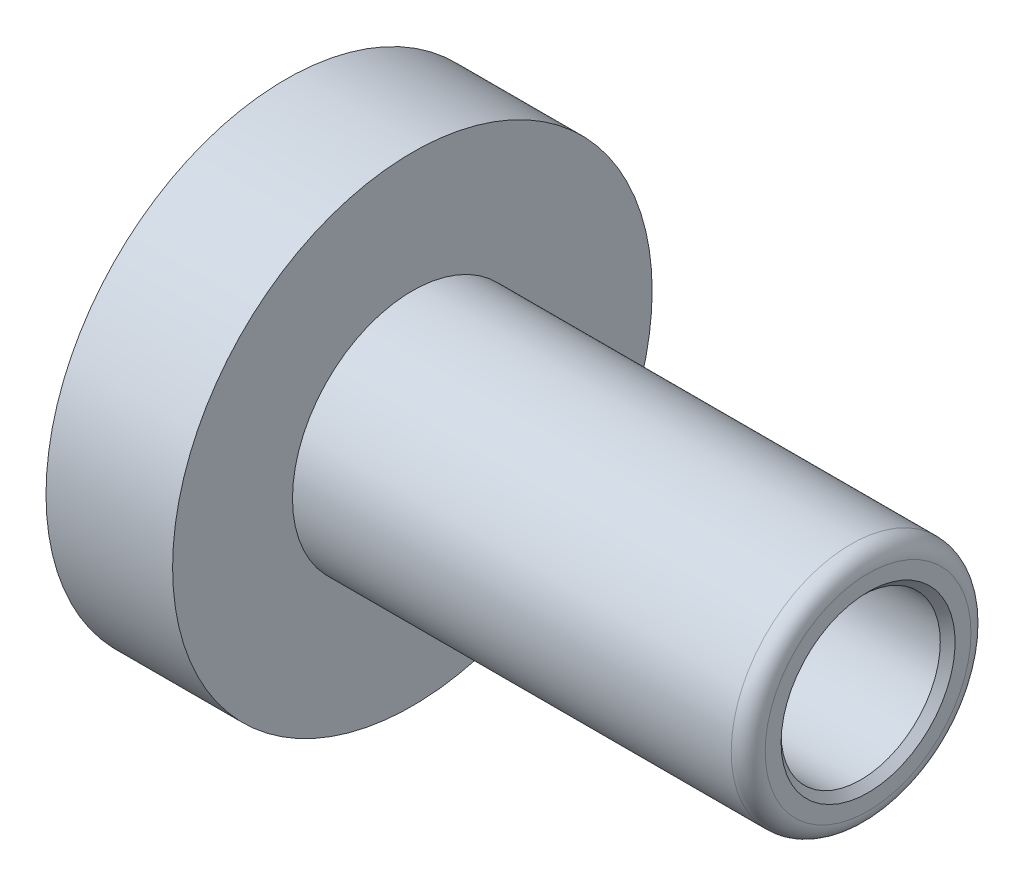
from build123d import *

# Parameters (mm, degrees)
SKETCH2_R          = 3.2004
CUT_EXTRUDE1_DEPTH = 7.9502
SKETCH3_R          = 7.3787
CUT_EXTRUDE2_DEPTH = 22.8092
CHAMFER1_SIZE      = 0.6858


with BuildPart() as part:
    # Sketch1 → Revolve1 (revolve)
    with BuildSketch(Plane.XY, mode=Mode.PRIVATE) as revolve1_sk:
        with BuildLine():
            Line((0, 8.128), (0, 22.225))
            Line((0, 22.225), (11.7348, 22.225))
            Line((11.7348, 22.225), (11.7348, 11.1125))
            Line((11.7348, 11.1125), (52.4002, 11.1125))
            ThreePointArc((52.4002, 11.1125), (53.513751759, 10.651251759), (53.975, 9.5377))
            Line((53.975, 9.5377), (53.975, 0))
            Line((53.975, 0), (28.067, 0))
            Line((28.067, 0), (28.067, 8.128))
            Line((28.067, 8.128), (0, 8.128))
        make_face()
    revolve(revolve1_sk.sketch.rotate(Axis((0, 0, 0), (1, 0, 0)), 90), axis=Axis((0, 0, 0), (1, 0, 0)))

    # Sketch2 → Cut-Extrude1 (cut)
    with BuildSketch(Plane.ZY):
        with Locations((0, 12.7)):
            Circle(SKETCH2_R)
        with Locations(Location((0, -12.7, 0), (0, 0, 180))):
            Circle(SKETCH2_R)
    extrude(amount=-CUT_EXTRUDE1_DEPTH, mode=Mode.SUBTRACT)

    # Sketch3 → Cut-Extrude2 (cut)
    with BuildSketch(Plane(origin=(53.975, 0, 0), x_dir=(0, 0, -1), z_dir=(1, 0, 0))):
        Circle(SKETCH3_R)
    extrude(amount=-CUT_EXTRUDE2_DEPTH, mode=Mode.SUBTRACT)

    # Chamfer1
    chamfer1_edges = [part.edges().sort_by_distance(p)[0] for p in [
        (53.975, 0, 7.3787),
    ]]
    chamfer(chamfer1_edges, length=CHAMFER1_SIZE)


solid = part.part
